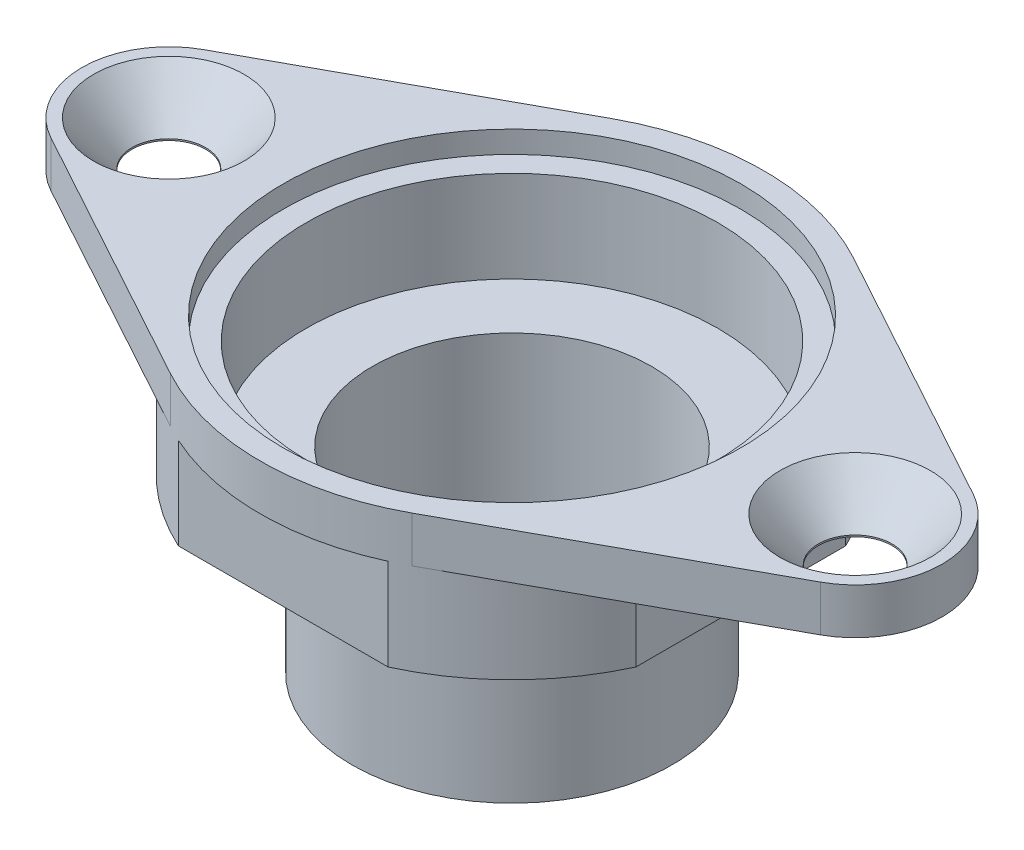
from build123d import *

# Parameters (mm, degrees)
SKETCH1_W                                       = 63.5
SKETCH1_H                                       = 50.8
BOSS_EXTRUDE1_DEPTH                             = 22.225
SKETCH2_R                                       = 14.26845
CUT_EXTRUDE1_DEPTH                              = 7.874
SKETCH5_R                                       = 15.875
CUT_EXTRUDE3_DEPTH                              = 1.524
CSK_FOR_10_FLAT_HEAD_MACHINE_SCREW1_D           = 5.1054
CSK_FOR_10_FLAT_HEAD_MACHINE_SCREW1_CSINK_D     = 10.4414066
CSK_FOR_10_FLAT_HEAD_MACHINE_SCREW1_CSINK_ANGLE = 82
SKETCH10_OUTSIDE_W                              = 82.36
SKETCH10_OUTSIDE_H                              = 69.66
CUT_EXTRUDE5_DEPTH                              = 25.4
SKETCH11_OUTSIDE_W                              = 76.218
SKETCH11_OUTSIDE_H                              = 51.453
SKETCH11_OUTSIDE_W_2                            = 31.75
SKETCH11_OUTSIDE_H_2                            = 31.75
CUT_EXTRUDE7_DEPTH                              = 19.05
SKETCH12_R                                      = 7.91845
CUT_EXTRUDE8_DEPTH                              = 77.400845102
SKETCH13_OUTSIDE_W                              = 76.218
SKETCH13_OUTSIDE_H                              = 51.453
SKETCH13_OUTSIDE_R                              = 11.1125
CUT_EXTRUDE9_DEPTH                              = 12.7
SKETCH15_R                                      = 9.68375
CUT_EXTRUDE11_DEPTH                             = 79.262944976
SKETCH17_W                                      = 57.462182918
SKETCH17_H                                      = 0.79375
CUT_EXTRUDE14_DEPTH                             = 81.007108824
SKETCH18_OUTSIDE_W                              = 76.17
SKETCH18_OUTSIDE_H                              = 51.405
SKETCH18_OUTSIDE_R                              = 17.4625
CUT_EXTRUDE15_DEPTH                             = 6.35


with BuildPart() as part:
    # Sketch1 → Boss-Extrude1 (new body)
    with BuildSketch(Plane(origin=(0, 0, 0), x_dir=(1, 0, 0), z_dir=(0, 1, 0))):
        with Locations((31.75, 25.4)):
            Rectangle(SKETCH1_W, SKETCH1_H)
    extrude(amount=BOSS_EXTRUDE1_DEPTH)

    # Sketch2 → Cut-Extrude1 (cut)
    with BuildSketch(Plane(origin=(0, 22.225, 0), x_dir=(1, 0, 0), z_dir=(0, 1, 0))):
        with Locations(Location((31.75, 25.4, 0), (0, 0, 270))):
            Circle(SKETCH2_R)
    extrude(amount=-CUT_EXTRUDE1_DEPTH, mode=Mode.SUBTRACT)

    # Sketch5 → Cut-Extrude3 (cut)
    with BuildSketch(Plane(origin=(0, 22.225, 0), x_dir=(1, 0, 0), z_dir=(0, 1, 0))):
        with Locations(Location((31.75, 25.4, 0), (0, 0, 270))):
            Circle(SKETCH5_R)
    extrude(amount=-CUT_EXTRUDE3_DEPTH, mode=Mode.SUBTRACT)

    # CSK for _10 Flat Head Machine Screw1 (through all)
    with Locations(Plane(origin=(0, 22.225, 0), x_dir=(1, 0, 0), z_dir=(0, 1, 0))):
        with Locations((7.9375, 25.4), (55.5625, 25.4)):
            CounterSinkHole(CSK_FOR_10_FLAT_HEAD_MACHINE_SCREW1_D / 2, CSK_FOR_10_FLAT_HEAD_MACHINE_SCREW1_CSINK_D / 2, counter_sink_angle=CSK_FOR_10_FLAT_HEAD_MACHINE_SCREW1_CSINK_ANGLE)

    # Sketch10 outside → Cut-Extrude5 (cut)
    with BuildSketch(Plane(origin=(0, 22.225, 0), x_dir=(1, 0, 0), z_dir=(0, 1, 0))):
        with Locations((31.75, 25.4)):
            Rectangle(SKETCH10_OUTSIDE_W, SKETCH10_OUTSIDE_H)
        with BuildLine():
            Line((40.132, 40.719300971), (58.4581, 30.692122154))
            ThreePointArc((58.4581, 30.692122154), (61.595, 25.4), (58.4581, 20.107877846))
            Line((58.4581, 20.107877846), (40.132, 10.080699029))
            ThreePointArc((40.132, 10.080699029), (31.75, 7.9375), (23.368, 10.080699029))
            Line((23.368, 10.080699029), (5.0419, 20.107877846))
            ThreePointArc((5.0419, 20.107877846), (1.905, 25.4), (5.0419, 30.692122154))
            Line((5.0419, 30.692122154), (23.368, 40.719300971))
            ThreePointArc((23.368, 40.719300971), (31.75, 42.8625), (40.132, 40.719300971))
        make_face(mode=Mode.SUBTRACT)
    extrude(amount=-CUT_EXTRUDE5_DEPTH, mode=Mode.SUBTRACT)

    # Sketch11 outside → Cut-Extrude7 (cut)
    with BuildSketch(Plane(origin=(0, 0, 0), x_dir=(-1, 0, 0), z_dir=(0, -1, 0))):
        with Locations((-31.75, 25.3995)):
            Rectangle(SKETCH11_OUTSIDE_W, SKETCH11_OUTSIDE_H)
        with Locations((-31.75, 25.4)):
            Rectangle(SKETCH11_OUTSIDE_W_2, SKETCH11_OUTSIDE_H_2, mode=Mode.SUBTRACT)
    extrude(amount=-CUT_EXTRUDE7_DEPTH, mode=Mode.SUBTRACT)

    # Sketch12 → Cut-Extrude8 (cut, through all)
    with BuildSketch(Plane(origin=(0, 14.351, 0), x_dir=(1, 0, 0), z_dir=(0, 1, 0))):
        with Locations(Location((31.75, 25.4, 0), (0, 0, 270))):
            Circle(SKETCH12_R)
    extrude(amount=-CUT_EXTRUDE8_DEPTH, mode=Mode.SUBTRACT)

    # Sketch13 outside → Cut-Extrude9 (cut)
    with BuildSketch(Plane(origin=(0, 0, 0), x_dir=(-1, 0, 0), z_dir=(0, -1, 0))):
        with Locations((-31.75, 25.3995)):
            Rectangle(SKETCH13_OUTSIDE_W, SKETCH13_OUTSIDE_H)
        with Locations(Location((-31.75, 25.4, 0), (0, 0, 90))):
            Circle(SKETCH13_OUTSIDE_R, mode=Mode.SUBTRACT)
    extrude(amount=-CUT_EXTRUDE9_DEPTH, mode=Mode.SUBTRACT)

    # Sketch15 → Cut-Extrude11 (cut, through all)
    with BuildSketch(Plane(origin=(0, 0, 0), x_dir=(-1, 0, 0), z_dir=(0, -1, 0))):
        with Locations(Location((-31.75, 25.4, 0), (0, 0, 90))):
            Circle(SKETCH15_R)
    extrude(amount=-CUT_EXTRUDE11_DEPTH, mode=Mode.SUBTRACT)

    # Sketch17 → Cut-Extrude14 (cut, through all)
    with BuildSketch(Plane(origin=(5.001542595, 0, 9.141032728), x_dir=(0.8772684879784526, 0, -0.47999999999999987), z_dir=(0.47999999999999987, 0, 0.8772684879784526))):
        with Locations((28.731091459, 0.396875)):
            Rectangle(SKETCH17_W, SKETCH17_H)
    extrude(amount=-CUT_EXTRUDE14_DEPTH, mode=Mode.SUBTRACT)

    # Sketch18 outside → Cut-Extrude15 (cut)
    with BuildSketch(Plane.XZ.offset(-12.7)):
        with Locations((31.75, -25.3995)):
            Rectangle(SKETCH18_OUTSIDE_W, SKETCH18_OUTSIDE_H)
        with Locations((31.75, -25.4)):
            Circle(SKETCH18_OUTSIDE_R, mode=Mode.SUBTRACT)
    extrude(amount=-CUT_EXTRUDE15_DEPTH, mode=Mode.SUBTRACT)


solid = part.part
